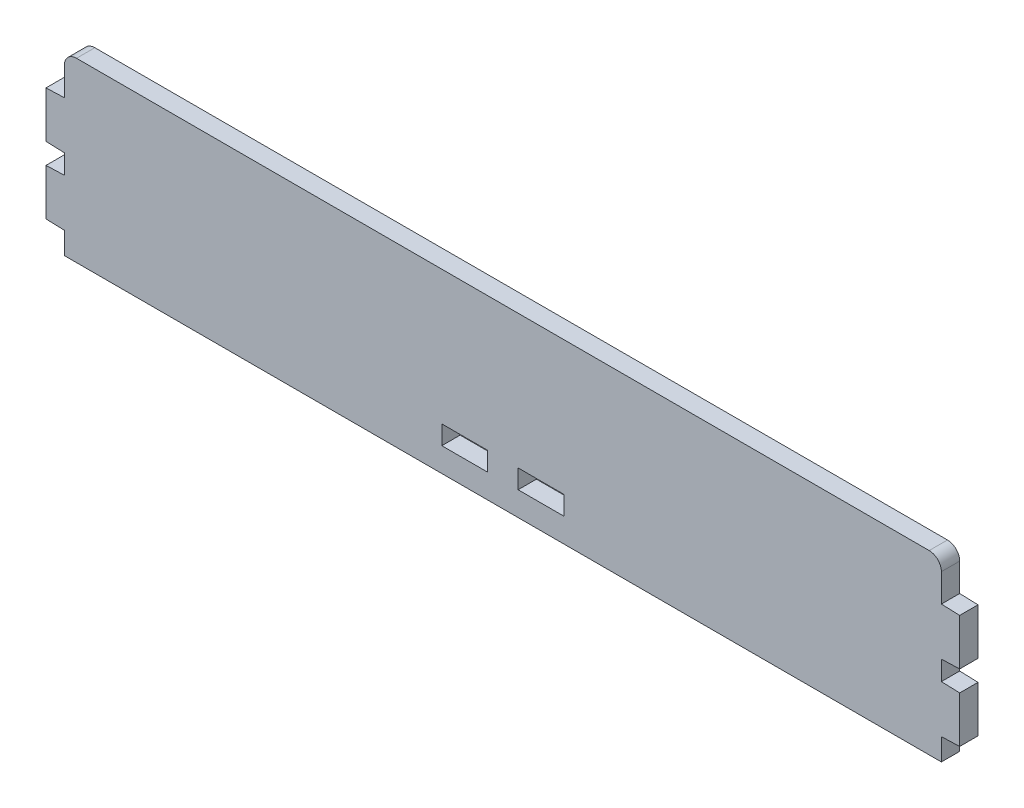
ISO-10303-21;
HEADER;
FILE_DESCRIPTION(('STEP AP214'),'2;1');
FILE_NAME('part.step','',(''),(''),'','','');
FILE_SCHEMA(('AUTOMOTIVE_DESIGN { 1 0 10303 214 1 1 1 1 }'));
ENDSEC;
DATA;
#1=APPLICATION_CONTEXT('core data for automotive mechanical design processes');
#2=APPLICATION_PROTOCOL_DEFINITION('international standard','automotive_design',2000,#1);
#3=PRODUCT_CONTEXT('',#1,'mechanical');
#4=PRODUCT('Part','Part','',(#3));
#5=PRODUCT_RELATED_PRODUCT_CATEGORY('part','',(#4));
#6=PRODUCT_DEFINITION_FORMATION('','',#4);
#7=PRODUCT_DEFINITION_CONTEXT('part definition',#1,'design');
#8=PRODUCT_DEFINITION('design','',#6,#7);
#9=PRODUCT_DEFINITION_SHAPE('','',#8);
#10=(LENGTH_UNIT() NAMED_UNIT(*) SI_UNIT(.MILLI.,.METRE.));
#11=(NAMED_UNIT(*) PLANE_ANGLE_UNIT() SI_UNIT($,.RADIAN.));
#12=(NAMED_UNIT(*) SI_UNIT($,.STERADIAN.) SOLID_ANGLE_UNIT());
#13=UNCERTAINTY_MEASURE_WITH_UNIT(LENGTH_MEASURE(1.E-05),#10,'distance_accuracy_value','');
#14=(GEOMETRIC_REPRESENTATION_CONTEXT(3) GLOBAL_UNCERTAINTY_ASSIGNED_CONTEXT((#13)) GLOBAL_UNIT_ASSIGNED_CONTEXT((#10,
#11,#12)) REPRESENTATION_CONTEXT('',''));
#15=CARTESIAN_POINT('',(0.,0.,0.));
#16=DIRECTION('',(0.,0.,1.));
#17=DIRECTION('',(1.,0.,0.));
#18=AXIS2_PLACEMENT_3D('',#15,#16,#17);
#19=CARTESIAN_POINT('',(146.5,66.,6.));
#20=DIRECTION('',(-1.,0.,0.));
#21=DIRECTION('',(0.,-1.,0.));
#22=AXIS2_PLACEMENT_3D('',#19,#20,#21);
#23=PLANE('',#22);
#24=DIRECTION('',(0.,1.,0.));
#25=VECTOR('',#24,1.);
#26=CARTESIAN_POINT('',(146.5,66.,0.));
#27=LINE('',#26,#25);
#28=CARTESIAN_POINT('',(146.5,30.8095246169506,0.));
#29=VERTEX_POINT('',#28);
#30=CARTESIAN_POINT('',(146.5,37.1904753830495,0.));
#31=VERTEX_POINT('',#30);
#32=EDGE_CURVE('E426',#29,#31,#27,.T.);
#33=ORIENTED_EDGE('',*,*,#32,.T.);
#34=DIRECTION('',(0.,0.,1.));
#35=VECTOR('',#34,1.);
#36=CARTESIAN_POINT('',(146.5,37.1904753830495,-16.7318468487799));
#37=LINE('',#36,#35);
#38=CARTESIAN_POINT('',(146.5,37.1904753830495,6.));
#39=VERTEX_POINT('',#38);
#40=EDGE_CURVE('E317',#31,#39,#37,.T.);
#41=ORIENTED_EDGE('',*,*,#40,.T.);
#42=DIRECTION('',(0.,1.,0.));
#43=VECTOR('',#42,1.);
#44=CARTESIAN_POINT('',(146.5,66.,6.));
#45=LINE('',#44,#43);
#46=CARTESIAN_POINT('',(146.5,30.8095246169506,6.));
#47=VERTEX_POINT('',#46);
#48=EDGE_CURVE('E413',#47,#39,#45,.T.);
#49=ORIENTED_EDGE('',*,*,#48,.F.);
#50=DIRECTION('',(0.,0.,1.));
#51=VECTOR('',#50,1.);
#52=CARTESIAN_POINT('',(146.5,30.8095246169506,-16.7318468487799));
#53=LINE('',#52,#51);
#54=EDGE_CURVE('E344',#29,#47,#53,.T.);
#55=ORIENTED_EDGE('',*,*,#54,.F.);
#56=EDGE_LOOP('',(#33,#41,#49,#55));
#57=FACE_BOUND('',#56,.T.);
#58=ADVANCED_FACE('F35',(#57),#23,.F.);
#59=CARTESIAN_POINT('',(146.5,52.8095246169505,0.));
#60=VERTEX_POINT('',#59);
#61=CARTESIAN_POINT('',(146.5,62.,0.));
#62=VERTEX_POINT('',#61);
#63=EDGE_CURVE('E422',#60,#62,#27,.T.);
#64=ORIENTED_EDGE('',*,*,#63,.T.);
#65=DIRECTION('',(0.,0.,-1.));
#66=VECTOR('',#65,1.);
#67=CARTESIAN_POINT('',(146.5,62.,6.));
#68=LINE('',#67,#66);
#69=CARTESIAN_POINT('',(146.5,62.,6.));
#70=VERTEX_POINT('',#69);
#71=EDGE_CURVE('E11',#62,#70,#68,.F.);
#72=ORIENTED_EDGE('',*,*,#71,.T.);
#73=CARTESIAN_POINT('',(146.5,52.8095246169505,6.));
#74=VERTEX_POINT('',#73);
#75=EDGE_CURVE('E408',#74,#70,#45,.T.);
#76=ORIENTED_EDGE('',*,*,#75,.F.);
#77=DIRECTION('',(0.,0.,1.));
#78=VECTOR('',#77,1.);
#79=CARTESIAN_POINT('',(146.5,52.8095246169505,-16.7318468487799));
#80=LINE('',#79,#78);
#81=EDGE_CURVE('E319',#60,#74,#80,.T.);
#82=ORIENTED_EDGE('',*,*,#81,.F.);
#83=EDGE_LOOP('',(#64,#72,#76,#82));
#84=FACE_BOUND('',#83,.T.);
#85=ADVANCED_FACE('F472',(#84),#23,.F.);
#86=CARTESIAN_POINT('',(-140.9,66.,6.));
#87=DIRECTION('',(1.,0.,0.));
#88=DIRECTION('',(0.,0.,-1.));
#89=AXIS2_PLACEMENT_3D('',#86,#87,#88);
#90=PLANE('',#89);
#91=DIRECTION('',(0.,-1.,0.));
#92=VECTOR('',#91,1.);
#93=CARTESIAN_POINT('',(-140.9,66.,6.));
#94=LINE('',#93,#92);
#95=CARTESIAN_POINT('',(-140.9,62.,6.));
#96=VERTEX_POINT('',#95);
#97=CARTESIAN_POINT('',(-140.9,52.8095246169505,6.));
#98=VERTEX_POINT('',#97);
#99=EDGE_CURVE('E402',#96,#98,#94,.T.);
#100=ORIENTED_EDGE('',*,*,#99,.F.);
#101=DIRECTION('',(0.,0.,-1.));
#102=VECTOR('',#101,1.);
#103=CARTESIAN_POINT('',(-140.9,62.,6.));
#104=LINE('',#103,#102);
#105=CARTESIAN_POINT('',(-140.9,62.,0.));
#106=VERTEX_POINT('',#105);
#107=EDGE_CURVE('E434',#96,#106,#104,.T.);
#108=ORIENTED_EDGE('',*,*,#107,.T.);
#109=DIRECTION('',(0.,-1.,0.));
#110=VECTOR('',#109,1.);
#111=CARTESIAN_POINT('',(-140.9,66.,0.));
#112=LINE('',#111,#110);
#113=CARTESIAN_POINT('',(-140.9,52.8095246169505,0.));
#114=VERTEX_POINT('',#113);
#115=EDGE_CURVE('E417',#106,#114,#112,.T.);
#116=ORIENTED_EDGE('',*,*,#115,.T.);
#117=DIRECTION('',(0.,0.,1.));
#118=VECTOR('',#117,1.);
#119=CARTESIAN_POINT('',(-140.9,52.8095246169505,-16.7318468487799));
#120=LINE('',#119,#118);
#121=EDGE_CURVE('E367',#114,#98,#120,.T.);
#122=ORIENTED_EDGE('',*,*,#121,.T.);
#123=EDGE_LOOP('',(#100,#108,#116,#122));
#124=FACE_BOUND('',#123,.T.);
#125=ADVANCED_FACE('F456',(#124),#90,.F.);
#126=DIRECTION('',(0.,0.,1.));
#127=VECTOR('',#126,1.);
#128=CARTESIAN_POINT('',(-140.9,15.1904753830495,-16.7318468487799));
#129=LINE('',#128,#127);
#130=CARTESIAN_POINT('',(-140.9,15.1904753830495,0.));
#131=VERTEX_POINT('',#130);
#132=CARTESIAN_POINT('',(-140.9,15.1904753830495,6.));
#133=VERTEX_POINT('',#132);
#134=EDGE_CURVE('E396',#131,#133,#129,.T.);
#135=ORIENTED_EDGE('',*,*,#134,.F.);
#136=CARTESIAN_POINT('',(-140.9,7.99999999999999,0.));
#137=VERTEX_POINT('',#136);
#138=EDGE_CURVE('E401',#131,#137,#112,.T.);
#139=ORIENTED_EDGE('',*,*,#138,.T.);
#140=DIRECTION('',(0.,0.,-1.));
#141=VECTOR('',#140,1.);
#142=CARTESIAN_POINT('',(-140.9,7.99999999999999,6.));
#143=LINE('',#142,#141);
#144=CARTESIAN_POINT('',(-140.9,7.99999999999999,6.));
#145=VERTEX_POINT('',#144);
#146=EDGE_CURVE('E431',#145,#137,#143,.T.);
#147=ORIENTED_EDGE('',*,*,#146,.F.);
#148=EDGE_CURVE('E406',#133,#145,#94,.T.);
#149=ORIENTED_EDGE('',*,*,#148,.F.);
#150=EDGE_LOOP('',(#135,#139,#147,#149));
#151=FACE_BOUND('',#150,.T.);
#152=ADVANCED_FACE('F677',(#151),#90,.F.);
#153=CARTESIAN_POINT('',(-140.9,37.1904753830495,6.));
#154=VERTEX_POINT('',#153);
#155=CARTESIAN_POINT('',(-140.9,30.8095246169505,6.));
#156=VERTEX_POINT('',#155);
#157=EDGE_CURVE('E405',#154,#156,#94,.T.);
#158=ORIENTED_EDGE('',*,*,#157,.F.);
#159=DIRECTION('',(0.,0.,1.));
#160=VECTOR('',#159,1.);
#161=CARTESIAN_POINT('',(-140.9,37.1904753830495,-16.7318468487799));
#162=LINE('',#161,#160);
#163=CARTESIAN_POINT('',(-140.9,37.1904753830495,0.));
#164=VERTEX_POINT('',#163);
#165=EDGE_CURVE('E370',#164,#154,#162,.T.);
#166=ORIENTED_EDGE('',*,*,#165,.F.);
#167=CARTESIAN_POINT('',(-140.9,30.8095246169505,0.));
#168=VERTEX_POINT('',#167);
#169=EDGE_CURVE('E420',#164,#168,#112,.T.);
#170=ORIENTED_EDGE('',*,*,#169,.T.);
#171=DIRECTION('',(0.,0.,1.));
#172=VECTOR('',#171,1.);
#173=CARTESIAN_POINT('',(-140.9,30.8095246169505,-16.7318468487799));
#174=LINE('',#173,#172);
#175=EDGE_CURVE('E393',#168,#156,#174,.T.);
#176=ORIENTED_EDGE('',*,*,#175,.T.);
#177=EDGE_LOOP('',(#158,#166,#170,#176));
#178=FACE_BOUND('',#177,.T.);
#179=ADVANCED_FACE('F522',(#178),#90,.F.);
#180=CARTESIAN_POINT('',(-140.9,7.99999999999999,6.));
#181=DIRECTION('',(0.,1.,0.));
#182=DIRECTION('',(0.,0.,1.));
#183=AXIS2_PLACEMENT_3D('',#180,#181,#182);
#184=PLANE('',#183);
#185=DIRECTION('',(1.,0.,0.));
#186=VECTOR('',#185,1.);
#187=CARTESIAN_POINT('',(-140.9,7.99999999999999,0.));
#188=LINE('',#187,#186);
#189=CARTESIAN_POINT('',(146.5,7.99999999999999,0.));
#190=VERTEX_POINT('',#189);
#191=EDGE_CURVE('E419',#137,#190,#188,.T.);
#192=ORIENTED_EDGE('',*,*,#191,.T.);
#193=DIRECTION('',(0.,0.,-1.));
#194=VECTOR('',#193,1.);
#195=CARTESIAN_POINT('',(146.5,7.99999999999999,6.));
#196=LINE('',#195,#194);
#197=CARTESIAN_POINT('',(146.5,7.99999999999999,6.));
#198=VERTEX_POINT('',#197);
#199=EDGE_CURVE('E416',#198,#190,#196,.T.);
#200=ORIENTED_EDGE('',*,*,#199,.F.);
#201=DIRECTION('',(1.,0.,0.));
#202=VECTOR('',#201,1.);
#203=CARTESIAN_POINT('',(-140.9,7.99999999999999,6.));
#204=LINE('',#203,#202);
#205=EDGE_CURVE('E404',#145,#198,#204,.T.);
#206=ORIENTED_EDGE('',*,*,#205,.F.);
#207=ORIENTED_EDGE('',*,*,#146,.T.);
#208=EDGE_LOOP('',(#192,#200,#206,#207));
#209=FACE_BOUND('',#208,.T.);
#210=ADVANCED_FACE('F516',(#209),#184,.F.);
#211=CARTESIAN_POINT('',(146.5,15.1904753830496,0.));
#212=VERTEX_POINT('',#211);
#213=EDGE_CURVE('E423',#190,#212,#27,.T.);
#214=ORIENTED_EDGE('',*,*,#213,.T.);
#215=DIRECTION('',(0.,0.,1.));
#216=VECTOR('',#215,1.);
#217=CARTESIAN_POINT('',(146.5,15.1904753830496,-16.7318468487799));
#218=LINE('',#217,#216);
#219=CARTESIAN_POINT('',(146.5,15.1904753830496,6.));
#220=VERTEX_POINT('',#219);
#221=EDGE_CURVE('E342',#212,#220,#218,.T.);
#222=ORIENTED_EDGE('',*,*,#221,.T.);
#223=EDGE_CURVE('E409',#198,#220,#45,.T.);
#224=ORIENTED_EDGE('',*,*,#223,.F.);
#225=ORIENTED_EDGE('',*,*,#199,.T.);
#226=EDGE_LOOP('',(#214,#222,#224,#225));
#227=FACE_BOUND('',#226,.T.);
#228=ADVANCED_FACE('F509',(#227),#23,.F.);
#229=CARTESIAN_POINT('',(-140.9,66.,6.));
#230=DIRECTION('',(0.,-1.,0.));
#231=DIRECTION('',(0.,0.,-1.));
#232=AXIS2_PLACEMENT_3D('',#229,#230,#231);
#233=PLANE('',#232);
#234=DIRECTION('',(-1.,0.,0.));
#235=VECTOR('',#234,1.);
#236=CARTESIAN_POINT('',(-140.9,66.,0.));
#237=LINE('',#236,#235);
#238=CARTESIAN_POINT('',(142.5,66.,0.));
#239=VERTEX_POINT('',#238);
#240=CARTESIAN_POINT('',(-136.9,66.,0.));
#241=VERTEX_POINT('',#240);
#242=EDGE_CURVE('E425',#239,#241,#237,.T.);
#243=ORIENTED_EDGE('',*,*,#242,.T.);
#244=DIRECTION('',(0.,0.,-1.));
#245=VECTOR('',#244,1.);
#246=CARTESIAN_POINT('',(-136.9,66.,6.));
#247=LINE('',#246,#245);
#248=CARTESIAN_POINT('',(-136.9,66.,6.));
#249=VERTEX_POINT('',#248);
#250=EDGE_CURVE('E444',#241,#249,#247,.F.);
#251=ORIENTED_EDGE('',*,*,#250,.T.);
#252=DIRECTION('',(-1.,0.,0.));
#253=VECTOR('',#252,1.);
#254=CARTESIAN_POINT('',(-140.9,66.,6.));
#255=LINE('',#254,#253);
#256=CARTESIAN_POINT('',(142.5,66.,6.));
#257=VERTEX_POINT('',#256);
#258=EDGE_CURVE('E412',#257,#249,#255,.T.);
#259=ORIENTED_EDGE('',*,*,#258,.F.);
#260=DIRECTION('',(0.,0.,-1.));
#261=VECTOR('',#260,1.);
#262=CARTESIAN_POINT('',(142.5,66.,6.));
#263=LINE('',#262,#261);
#264=EDGE_CURVE('E441',#257,#239,#263,.T.);
#265=ORIENTED_EDGE('',*,*,#264,.T.);
#266=EDGE_LOOP('',(#243,#251,#259,#265));
#267=FACE_BOUND('',#266,.T.);
#268=ADVANCED_FACE('F464',(#267),#233,.F.);
#269=CARTESIAN_POINT('',(0.,0.,6.));
#270=DIRECTION('',(0.,0.,1.));
#271=DIRECTION('',(1.,0.,0.));
#272=AXIS2_PLACEMENT_3D('',#269,#270,#271);
#273=PLANE('',#272);
#274=DIRECTION('',(0.,-1.,0.));
#275=VECTOR('',#274,1.);
#276=CARTESIAN_POINT('',(-17.1999999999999,22.1,6.));
#277=LINE('',#276,#275);
#278=CARTESIAN_POINT('',(-17.1999999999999,22.1,6.));
#279=VERTEX_POINT('',#278);
#280=CARTESIAN_POINT('',(-17.1999999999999,15.9,6.));
#281=VERTEX_POINT('',#280);
#282=EDGE_CURVE('E50',#279,#281,#277,.T.);
#283=ORIENTED_EDGE('',*,*,#282,.F.);
#284=DIRECTION('',(-1.,0.,0.));
#285=VECTOR('',#284,1.);
#286=CARTESIAN_POINT('',(-2.19999999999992,22.1,6.));
#287=LINE('',#286,#285);
#288=CARTESIAN_POINT('',(-2.19999999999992,22.1,6.));
#289=VERTEX_POINT('',#288);
#290=EDGE_CURVE('E239',#289,#279,#287,.T.);
#291=ORIENTED_EDGE('',*,*,#290,.F.);
#292=DIRECTION('',(0.,1.,0.));
#293=VECTOR('',#292,1.);
#294=CARTESIAN_POINT('',(-2.19999999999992,15.9,6.));
#295=LINE('',#294,#293);
#296=CARTESIAN_POINT('',(-2.19999999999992,15.9,6.));
#297=VERTEX_POINT('',#296);
#298=EDGE_CURVE('E262',#297,#289,#295,.T.);
#299=ORIENTED_EDGE('',*,*,#298,.F.);
#300=DIRECTION('',(1.,0.,0.));
#301=VECTOR('',#300,1.);
#302=CARTESIAN_POINT('',(-17.1999999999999,15.9,6.));
#303=LINE('',#302,#301);
#304=EDGE_CURVE('E255',#281,#297,#303,.T.);
#305=ORIENTED_EDGE('',*,*,#304,.F.);
#306=EDGE_LOOP('',(#283,#291,#299,#305));
#307=FACE_BOUND('',#306,.T.);
#308=DIRECTION('',(0.,-1.,0.));
#309=VECTOR('',#308,1.);
#310=CARTESIAN_POINT('',(7.80000000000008,22.1,6.));
#311=LINE('',#310,#309);
#312=CARTESIAN_POINT('',(7.80000000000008,22.1,6.));
#313=VERTEX_POINT('',#312);
#314=CARTESIAN_POINT('',(7.80000000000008,15.9,6.));
#315=VERTEX_POINT('',#314);
#316=EDGE_CURVE('E58',#313,#315,#311,.T.);
#317=ORIENTED_EDGE('',*,*,#316,.F.);
#318=DIRECTION('',(-1.,0.,0.));
#319=VECTOR('',#318,1.);
#320=CARTESIAN_POINT('',(22.8000000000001,22.1,6.));
#321=LINE('',#320,#319);
#322=CARTESIAN_POINT('',(22.8000000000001,22.1,6.));
#323=VERTEX_POINT('',#322);
#324=EDGE_CURVE('E286',#323,#313,#321,.T.);
#325=ORIENTED_EDGE('',*,*,#324,.F.);
#326=DIRECTION('',(0.,1.,0.));
#327=VECTOR('',#326,1.);
#328=CARTESIAN_POINT('',(22.8000000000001,15.9,6.));
#329=LINE('',#328,#327);
#330=CARTESIAN_POINT('',(22.8000000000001,15.9,6.));
#331=VERTEX_POINT('',#330);
#332=EDGE_CURVE('E283',#331,#323,#329,.T.);
#333=ORIENTED_EDGE('',*,*,#332,.F.);
#334=DIRECTION('',(1.,0.,0.));
#335=VECTOR('',#334,1.);
#336=CARTESIAN_POINT('',(7.80000000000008,15.9,6.));
#337=LINE('',#336,#335);
#338=EDGE_CURVE('E280',#315,#331,#337,.T.);
#339=ORIENTED_EDGE('',*,*,#338,.F.);
#340=EDGE_LOOP('',(#317,#325,#333,#339));
#341=FACE_BOUND('',#340,.T.);
#342=ORIENTED_EDGE('',*,*,#258,.T.);
#343=CARTESIAN_POINT('',(-136.9,62.,6.));
#344=DIRECTION('',(0.,0.,1.));
#345=DIRECTION('',(1.,0.,0.));
#346=AXIS2_PLACEMENT_3D('',#343,#344,#345);
#347=CIRCLE('',#346,4.);
#348=EDGE_CURVE('E43',#249,#96,#347,.T.);
#349=ORIENTED_EDGE('',*,*,#348,.T.);
#350=ORIENTED_EDGE('',*,*,#99,.T.);
#351=DIRECTION('',(-0.999390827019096,-0.0348994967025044,0.));
#352=VECTOR('',#351,1.);
#353=CARTESIAN_POINT('',(-140.9,52.8095246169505,6.));
#354=LINE('',#353,#352);
#355=CARTESIAN_POINT('',(-146.9,52.6,6.));
#356=VERTEX_POINT('',#355);
#357=EDGE_CURVE('E362',#98,#356,#354,.T.);
#358=ORIENTED_EDGE('',*,*,#357,.T.);
#359=DIRECTION('',(0.,-1.,0.));
#360=VECTOR('',#359,1.);
#361=CARTESIAN_POINT('',(-146.9,52.6,6.));
#362=LINE('',#361,#360);
#363=CARTESIAN_POINT('',(-146.9,37.4,6.));
#364=VERTEX_POINT('',#363);
#365=EDGE_CURVE('E349',#356,#364,#362,.T.);
#366=ORIENTED_EDGE('',*,*,#365,.T.);
#367=DIRECTION('',(0.999390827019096,-0.0348994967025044,0.));
#368=VECTOR('',#367,1.);
#369=CARTESIAN_POINT('',(-140.9,37.1904753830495,6.));
#370=LINE('',#369,#368);
#371=EDGE_CURVE('E359',#364,#154,#370,.T.);
#372=ORIENTED_EDGE('',*,*,#371,.T.);
#373=ORIENTED_EDGE('',*,*,#157,.T.);
#374=DIRECTION('',(-0.999390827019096,-0.0348994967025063,0.));
#375=VECTOR('',#374,1.);
#376=CARTESIAN_POINT('',(-140.9,30.8095246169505,6.));
#377=LINE('',#376,#375);
#378=CARTESIAN_POINT('',(-146.9,30.6,6.));
#379=VERTEX_POINT('',#378);
#380=EDGE_CURVE('E388',#156,#379,#377,.T.);
#381=ORIENTED_EDGE('',*,*,#380,.T.);
#382=DIRECTION('',(0.,-1.,0.));
#383=VECTOR('',#382,1.);
#384=CARTESIAN_POINT('',(-146.9,30.6,6.));
#385=LINE('',#384,#383);
#386=CARTESIAN_POINT('',(-146.9,15.4,6.));
#387=VERTEX_POINT('',#386);
#388=EDGE_CURVE('E375',#379,#387,#385,.T.);
#389=ORIENTED_EDGE('',*,*,#388,.T.);
#390=DIRECTION('',(0.999390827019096,-0.0348994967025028,0.));
#391=VECTOR('',#390,1.);
#392=CARTESIAN_POINT('',(-140.9,15.1904753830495,6.));
#393=LINE('',#392,#391);
#394=EDGE_CURVE('E385',#387,#133,#393,.T.);
#395=ORIENTED_EDGE('',*,*,#394,.T.);
#396=ORIENTED_EDGE('',*,*,#148,.T.);
#397=ORIENTED_EDGE('',*,*,#205,.T.);
#398=ORIENTED_EDGE('',*,*,#223,.T.);
#399=DIRECTION('',(0.999390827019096,0.034899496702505,0.));
#400=VECTOR('',#399,1.);
#401=CARTESIAN_POINT('',(146.5,15.1904753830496,6.));
#402=LINE('',#401,#400);
#403=CARTESIAN_POINT('',(152.5,15.4000000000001,6.));
#404=VERTEX_POINT('',#403);
#405=EDGE_CURVE('E337',#220,#404,#402,.T.);
#406=ORIENTED_EDGE('',*,*,#405,.T.);
#407=DIRECTION('',(0.,1.,0.));
#408=VECTOR('',#407,1.);
#409=CARTESIAN_POINT('',(152.5,15.4000000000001,6.));
#410=LINE('',#409,#408);
#411=CARTESIAN_POINT('',(152.5,30.6000000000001,6.));
#412=VERTEX_POINT('',#411);
#413=EDGE_CURVE('E324',#404,#412,#410,.T.);
#414=ORIENTED_EDGE('',*,*,#413,.T.);
#415=DIRECTION('',(-0.999390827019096,0.0348994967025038,0.));
#416=VECTOR('',#415,1.);
#417=CARTESIAN_POINT('',(146.5,30.8095246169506,6.));
#418=LINE('',#417,#416);
#419=EDGE_CURVE('E334',#412,#47,#418,.T.);
#420=ORIENTED_EDGE('',*,*,#419,.T.);
#421=ORIENTED_EDGE('',*,*,#48,.T.);
#422=DIRECTION('',(0.999390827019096,0.0348994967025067,0.));
#423=VECTOR('',#422,1.);
#424=CARTESIAN_POINT('',(146.5,37.1904753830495,6.));
#425=LINE('',#424,#423);
#426=CARTESIAN_POINT('',(152.5,37.4000000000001,6.));
#427=VERTEX_POINT('',#426);
#428=EDGE_CURVE('E312',#39,#427,#425,.T.);
#429=ORIENTED_EDGE('',*,*,#428,.T.);
#430=DIRECTION('',(0.,1.,0.));
#431=VECTOR('',#430,1.);
#432=CARTESIAN_POINT('',(152.5,37.4000000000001,6.));
#433=LINE('',#432,#431);
#434=CARTESIAN_POINT('',(152.5,52.6000000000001,6.));
#435=VERTEX_POINT('',#434);
#436=EDGE_CURVE('E247',#427,#435,#433,.T.);
#437=ORIENTED_EDGE('',*,*,#436,.T.);
#438=DIRECTION('',(-0.999390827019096,0.0348994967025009,0.));
#439=VECTOR('',#438,1.);
#440=CARTESIAN_POINT('',(146.5,52.8095246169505,6.));
#441=LINE('',#440,#439);
#442=EDGE_CURVE('E309',#435,#74,#441,.T.);
#443=ORIENTED_EDGE('',*,*,#442,.T.);
#444=ORIENTED_EDGE('',*,*,#75,.T.);
#445=CARTESIAN_POINT('',(142.5,62.,6.));
#446=DIRECTION('',(0.,0.,1.));
#447=DIRECTION('',(1.,0.,0.));
#448=AXIS2_PLACEMENT_3D('',#445,#446,#447);
#449=CIRCLE('',#448,4.);
#450=EDGE_CURVE('E446',#70,#257,#449,.T.);
#451=ORIENTED_EDGE('',*,*,#450,.T.);
#452=EDGE_LOOP('',(#342,#349,#350,#358,#366,#372,#373,#381,#389,#395,#396,#397,#398,#406,#414,
#420,#421,#429,#437,#443,#444,#451));
#453=FACE_BOUND('',#452,.T.);
#454=ADVANCED_FACE('F450',(#307,#341,#453),#273,.T.);
#455=CARTESIAN_POINT('',(0.,0.,0.));
#456=DIRECTION('',(0.,0.,1.));
#457=DIRECTION('',(1.,0.,0.));
#458=AXIS2_PLACEMENT_3D('',#455,#456,#457);
#459=PLANE('',#458);
#460=DIRECTION('',(1.,0.,0.));
#461=VECTOR('',#460,1.);
#462=CARTESIAN_POINT('',(-2.19999999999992,22.1,0.));
#463=LINE('',#462,#461);
#464=CARTESIAN_POINT('',(-17.1999999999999,22.1,0.));
#465=VERTEX_POINT('',#464);
#466=CARTESIAN_POINT('',(-2.19999999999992,22.1,0.));
#467=VERTEX_POINT('',#466);
#468=EDGE_CURVE('E253',#465,#467,#463,.T.);
#469=ORIENTED_EDGE('',*,*,#468,.F.);
#470=DIRECTION('',(0.,1.,0.));
#471=VECTOR('',#470,1.);
#472=CARTESIAN_POINT('',(-17.1999999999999,22.1,0.));
#473=LINE('',#472,#471);
#474=CARTESIAN_POINT('',(-17.1999999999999,15.9,0.));
#475=VERTEX_POINT('',#474);
#476=EDGE_CURVE('E233',#475,#465,#473,.T.);
#477=ORIENTED_EDGE('',*,*,#476,.F.);
#478=DIRECTION('',(-1.,0.,0.));
#479=VECTOR('',#478,1.);
#480=CARTESIAN_POINT('',(-17.1999999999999,15.9,0.));
#481=LINE('',#480,#479);
#482=CARTESIAN_POINT('',(-2.19999999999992,15.9,0.));
#483=VERTEX_POINT('',#482);
#484=EDGE_CURVE('E243',#483,#475,#481,.T.);
#485=ORIENTED_EDGE('',*,*,#484,.F.);
#486=DIRECTION('',(0.,-1.,0.));
#487=VECTOR('',#486,1.);
#488=CARTESIAN_POINT('',(-2.19999999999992,15.9,0.));
#489=LINE('',#488,#487);
#490=EDGE_CURVE('E257',#467,#483,#489,.T.);
#491=ORIENTED_EDGE('',*,*,#490,.F.);
#492=EDGE_LOOP('',(#469,#477,#485,#491));
#493=FACE_BOUND('',#492,.T.);
#494=DIRECTION('',(1.,0.,0.));
#495=VECTOR('',#494,1.);
#496=CARTESIAN_POINT('',(22.8000000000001,22.1,0.));
#497=LINE('',#496,#495);
#498=CARTESIAN_POINT('',(7.80000000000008,22.1,0.));
#499=VERTEX_POINT('',#498);
#500=CARTESIAN_POINT('',(22.8000000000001,22.1,0.));
#501=VERTEX_POINT('',#500);
#502=EDGE_CURVE('E273',#499,#501,#497,.T.);
#503=ORIENTED_EDGE('',*,*,#502,.F.);
#504=DIRECTION('',(0.,1.,0.));
#505=VECTOR('',#504,1.);
#506=CARTESIAN_POINT('',(7.80000000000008,22.1,0.));
#507=LINE('',#506,#505);
#508=CARTESIAN_POINT('',(7.80000000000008,15.9,0.));
#509=VERTEX_POINT('',#508);
#510=EDGE_CURVE('E276',#509,#499,#507,.T.);
#511=ORIENTED_EDGE('',*,*,#510,.F.);
#512=DIRECTION('',(-1.,0.,0.));
#513=VECTOR('',#512,1.);
#514=CARTESIAN_POINT('',(7.80000000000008,15.9,0.));
#515=LINE('',#514,#513);
#516=CARTESIAN_POINT('',(22.8000000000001,15.9,0.));
#517=VERTEX_POINT('',#516);
#518=EDGE_CURVE('E292',#517,#509,#515,.T.);
#519=ORIENTED_EDGE('',*,*,#518,.F.);
#520=DIRECTION('',(0.,-1.,0.));
#521=VECTOR('',#520,1.);
#522=CARTESIAN_POINT('',(22.8000000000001,15.9,0.));
#523=LINE('',#522,#521);
#524=EDGE_CURVE('E271',#501,#517,#523,.T.);
#525=ORIENTED_EDGE('',*,*,#524,.F.);
#526=EDGE_LOOP('',(#503,#511,#519,#525));
#527=FACE_BOUND('',#526,.T.);
#528=ORIENTED_EDGE('',*,*,#115,.F.);
#529=CARTESIAN_POINT('',(-136.9,62.,0.));
#530=DIRECTION('',(0.,0.,1.));
#531=DIRECTION('',(1.,0.,0.));
#532=AXIS2_PLACEMENT_3D('',#529,#530,#531);
#533=CIRCLE('',#532,4.);
#534=EDGE_CURVE('E439',#106,#241,#533,.F.);
#535=ORIENTED_EDGE('',*,*,#534,.T.);
#536=ORIENTED_EDGE('',*,*,#242,.F.);
#537=CARTESIAN_POINT('',(142.5,62.,0.));
#538=DIRECTION('',(0.,0.,1.));
#539=DIRECTION('',(1.,0.,0.));
#540=AXIS2_PLACEMENT_3D('',#537,#538,#539);
#541=CIRCLE('',#540,4.);
#542=EDGE_CURVE('E437',#239,#62,#541,.F.);
#543=ORIENTED_EDGE('',*,*,#542,.T.);
#544=ORIENTED_EDGE('',*,*,#63,.F.);
#545=DIRECTION('',(0.999390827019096,-0.0348994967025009,0.));
#546=VECTOR('',#545,1.);
#547=CARTESIAN_POINT('',(146.5,52.8095246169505,0.));
#548=LINE('',#547,#546);
#549=CARTESIAN_POINT('',(152.5,52.6000000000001,0.));
#550=VERTEX_POINT('',#549);
#551=EDGE_CURVE('E306',#60,#550,#548,.T.);
#552=ORIENTED_EDGE('',*,*,#551,.T.);
#553=DIRECTION('',(0.,-1.,0.));
#554=VECTOR('',#553,1.);
#555=CARTESIAN_POINT('',(152.5,37.4000000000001,0.));
#556=LINE('',#555,#554);
#557=CARTESIAN_POINT('',(152.5,37.4000000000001,0.));
#558=VERTEX_POINT('',#557);
#559=EDGE_CURVE('E303',#550,#558,#556,.T.);
#560=ORIENTED_EDGE('',*,*,#559,.T.);
#561=DIRECTION('',(-0.999390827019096,-0.0348994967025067,0.));
#562=VECTOR('',#561,1.);
#563=CARTESIAN_POINT('',(146.5,37.1904753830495,0.));
#564=LINE('',#563,#562);
#565=EDGE_CURVE('E300',#558,#31,#564,.T.);
#566=ORIENTED_EDGE('',*,*,#565,.T.);
#567=ORIENTED_EDGE('',*,*,#32,.F.);
#568=DIRECTION('',(0.999390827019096,-0.0348994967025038,0.));
#569=VECTOR('',#568,1.);
#570=CARTESIAN_POINT('',(146.5,30.8095246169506,0.));
#571=LINE('',#570,#569);
#572=CARTESIAN_POINT('',(152.5,30.6000000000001,0.));
#573=VERTEX_POINT('',#572);
#574=EDGE_CURVE('E331',#29,#573,#571,.T.);
#575=ORIENTED_EDGE('',*,*,#574,.T.);
#576=DIRECTION('',(0.,-1.,0.));
#577=VECTOR('',#576,1.);
#578=CARTESIAN_POINT('',(152.5,15.4000000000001,0.));
#579=LINE('',#578,#577);
#580=CARTESIAN_POINT('',(152.5,15.4000000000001,0.));
#581=VERTEX_POINT('',#580);
#582=EDGE_CURVE('E328',#573,#581,#579,.T.);
#583=ORIENTED_EDGE('',*,*,#582,.T.);
#584=DIRECTION('',(-0.999390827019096,-0.034899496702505,0.));
#585=VECTOR('',#584,1.);
#586=CARTESIAN_POINT('',(146.5,15.1904753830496,0.));
#587=LINE('',#586,#585);
#588=EDGE_CURVE('E325',#581,#212,#587,.T.);
#589=ORIENTED_EDGE('',*,*,#588,.T.);
#590=ORIENTED_EDGE('',*,*,#213,.F.);
#591=ORIENTED_EDGE('',*,*,#191,.F.);
#592=ORIENTED_EDGE('',*,*,#138,.F.);
#593=DIRECTION('',(-0.999390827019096,0.0348994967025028,0.));
#594=VECTOR('',#593,1.);
#595=CARTESIAN_POINT('',(-140.9,15.1904753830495,0.));
#596=LINE('',#595,#594);
#597=CARTESIAN_POINT('',(-146.9,15.4,0.));
#598=VERTEX_POINT('',#597);
#599=EDGE_CURVE('E382',#131,#598,#596,.T.);
#600=ORIENTED_EDGE('',*,*,#599,.T.);
#601=DIRECTION('',(0.,1.,0.));
#602=VECTOR('',#601,1.);
#603=CARTESIAN_POINT('',(-146.9,30.6,0.));
#604=LINE('',#603,#602);
#605=CARTESIAN_POINT('',(-146.9,30.6,0.));
#606=VERTEX_POINT('',#605);
#607=EDGE_CURVE('E379',#598,#606,#604,.T.);
#608=ORIENTED_EDGE('',*,*,#607,.T.);
#609=DIRECTION('',(0.999390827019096,0.0348994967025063,0.));
#610=VECTOR('',#609,1.);
#611=CARTESIAN_POINT('',(-140.9,30.8095246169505,0.));
#612=LINE('',#611,#610);
#613=EDGE_CURVE('E376',#606,#168,#612,.T.);
#614=ORIENTED_EDGE('',*,*,#613,.T.);
#615=ORIENTED_EDGE('',*,*,#169,.F.);
#616=DIRECTION('',(-0.999390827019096,0.0348994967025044,0.));
#617=VECTOR('',#616,1.);
#618=CARTESIAN_POINT('',(-140.9,37.1904753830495,0.));
#619=LINE('',#618,#617);
#620=CARTESIAN_POINT('',(-146.9,37.4,0.));
#621=VERTEX_POINT('',#620);
#622=EDGE_CURVE('E356',#164,#621,#619,.T.);
#623=ORIENTED_EDGE('',*,*,#622,.T.);
#624=DIRECTION('',(0.,1.,0.));
#625=VECTOR('',#624,1.);
#626=CARTESIAN_POINT('',(-146.9,52.6,0.));
#627=LINE('',#626,#625);
#628=CARTESIAN_POINT('',(-146.9,52.6,0.));
#629=VERTEX_POINT('',#628);
#630=EDGE_CURVE('E353',#621,#629,#627,.T.);
#631=ORIENTED_EDGE('',*,*,#630,.T.);
#632=DIRECTION('',(0.999390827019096,0.0348994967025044,0.));
#633=VECTOR('',#632,1.);
#634=CARTESIAN_POINT('',(-140.9,52.8095246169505,0.));
#635=LINE('',#634,#633);
#636=EDGE_CURVE('E350',#629,#114,#635,.T.);
#637=ORIENTED_EDGE('',*,*,#636,.T.);
#638=EDGE_LOOP('',(#528,#535,#536,#543,#544,#552,#560,#566,#567,#575,#583,#589,#590,#591,#592,
#600,#608,#614,#615,#623,#631,#637));
#639=FACE_BOUND('',#638,.T.);
#640=ADVANCED_FACE('F250',(#493,#527,#639),#459,.F.);
#641=CARTESIAN_POINT('',(-146.9,30.6,-16.7318468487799));
#642=DIRECTION('',(-1.,0.,0.));
#643=DIRECTION('',(0.,-1.,0.));
#644=AXIS2_PLACEMENT_3D('',#641,#642,#643);
#645=PLANE('',#644);
#646=ORIENTED_EDGE('',*,*,#607,.F.);
#647=DIRECTION('',(0.,0.,1.));
#648=VECTOR('',#647,1.);
#649=CARTESIAN_POINT('',(-146.9,15.4,-16.7318468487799));
#650=LINE('',#649,#648);
#651=EDGE_CURVE('E391',#598,#387,#650,.T.);
#652=ORIENTED_EDGE('',*,*,#651,.T.);
#653=ORIENTED_EDGE('',*,*,#388,.F.);
#654=DIRECTION('',(0.,0.,1.));
#655=VECTOR('',#654,1.);
#656=CARTESIAN_POINT('',(-146.9,30.6,-16.7318468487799));
#657=LINE('',#656,#655);
#658=EDGE_CURVE('E380',#606,#379,#657,.T.);
#659=ORIENTED_EDGE('',*,*,#658,.F.);
#660=EDGE_LOOP('',(#646,#652,#653,#659));
#661=FACE_BOUND('',#660,.T.);
#662=ADVANCED_FACE('F547',(#661),#645,.T.);
#663=CARTESIAN_POINT('',(-140.9,30.8095246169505,-16.7318468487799));
#664=DIRECTION('',(-0.0348994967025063,0.999390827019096,0.));
#665=DIRECTION('',(-0.999390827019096,-0.0348994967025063,0.));
#666=AXIS2_PLACEMENT_3D('',#663,#664,#665);
#667=PLANE('',#666);
#668=ORIENTED_EDGE('',*,*,#613,.F.);
#669=ORIENTED_EDGE('',*,*,#658,.T.);
#670=ORIENTED_EDGE('',*,*,#380,.F.);
#671=ORIENTED_EDGE('',*,*,#175,.F.);
#672=EDGE_LOOP('',(#668,#669,#670,#671));
#673=FACE_BOUND('',#672,.T.);
#674=ADVANCED_FACE('F552',(#673),#667,.T.);
#675=CARTESIAN_POINT('',(-140.9,15.1904753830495,-16.7318468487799));
#676=DIRECTION('',(-0.0348994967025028,-0.999390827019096,0.));
#677=DIRECTION('',(0.999390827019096,-0.0348994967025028,0.));
#678=AXIS2_PLACEMENT_3D('',#675,#676,#677);
#679=PLANE('',#678);
#680=ORIENTED_EDGE('',*,*,#599,.F.);
#681=ORIENTED_EDGE('',*,*,#134,.T.);
#682=ORIENTED_EDGE('',*,*,#394,.F.);
#683=ORIENTED_EDGE('',*,*,#651,.F.);
#684=EDGE_LOOP('',(#680,#681,#682,#683));
#685=FACE_BOUND('',#684,.T.);
#686=ADVANCED_FACE('F543',(#685),#679,.T.);
#687=CARTESIAN_POINT('',(-146.9,52.6,-16.7318468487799));
#688=DIRECTION('',(-1.,0.,0.));
#689=DIRECTION('',(0.,0.,1.));
#690=AXIS2_PLACEMENT_3D('',#687,#688,#689);
#691=PLANE('',#690);
#692=ORIENTED_EDGE('',*,*,#630,.F.);
#693=DIRECTION('',(0.,0.,1.));
#694=VECTOR('',#693,1.);
#695=CARTESIAN_POINT('',(-146.9,37.4,-16.7318468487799));
#696=LINE('',#695,#694);
#697=EDGE_CURVE('E365',#621,#364,#696,.T.);
#698=ORIENTED_EDGE('',*,*,#697,.T.);
#699=ORIENTED_EDGE('',*,*,#365,.F.);
#700=DIRECTION('',(0.,0.,1.));
#701=VECTOR('',#700,1.);
#702=CARTESIAN_POINT('',(-146.9,52.6,-16.7318468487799));
#703=LINE('',#702,#701);
#704=EDGE_CURVE('E354',#629,#356,#703,.T.);
#705=ORIENTED_EDGE('',*,*,#704,.F.);
#706=EDGE_LOOP('',(#692,#698,#699,#705));
#707=FACE_BOUND('',#706,.T.);
#708=ADVANCED_FACE('F563',(#707),#691,.T.);
#709=CARTESIAN_POINT('',(-140.9,52.8095246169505,-16.7318468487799));
#710=DIRECTION('',(-0.0348994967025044,0.999390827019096,0.));
#711=DIRECTION('',(-0.999390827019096,-0.0348994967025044,0.));
#712=AXIS2_PLACEMENT_3D('',#709,#710,#711);
#713=PLANE('',#712);
#714=ORIENTED_EDGE('',*,*,#636,.F.);
#715=ORIENTED_EDGE('',*,*,#704,.T.);
#716=ORIENTED_EDGE('',*,*,#357,.F.);
#717=ORIENTED_EDGE('',*,*,#121,.F.);
#718=EDGE_LOOP('',(#714,#715,#716,#717));
#719=FACE_BOUND('',#718,.T.);
#720=ADVANCED_FACE('F568',(#719),#713,.T.);
#721=CARTESIAN_POINT('',(-140.9,37.1904753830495,-16.7318468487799));
#722=DIRECTION('',(-0.0348994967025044,-0.999390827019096,0.));
#723=DIRECTION('',(0.999390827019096,-0.0348994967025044,0.));
#724=AXIS2_PLACEMENT_3D('',#721,#722,#723);
#725=PLANE('',#724);
#726=ORIENTED_EDGE('',*,*,#622,.F.);
#727=ORIENTED_EDGE('',*,*,#165,.T.);
#728=ORIENTED_EDGE('',*,*,#371,.F.);
#729=ORIENTED_EDGE('',*,*,#697,.F.);
#730=EDGE_LOOP('',(#726,#727,#728,#729));
#731=FACE_BOUND('',#730,.T.);
#732=ADVANCED_FACE('F566',(#731),#725,.T.);
#733=CARTESIAN_POINT('',(152.5,15.4000000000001,-16.7318468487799));
#734=DIRECTION('',(1.,0.,0.));
#735=DIRECTION('',(0.,0.,-1.));
#736=AXIS2_PLACEMENT_3D('',#733,#734,#735);
#737=PLANE('',#736);
#738=ORIENTED_EDGE('',*,*,#582,.F.);
#739=DIRECTION('',(0.,0.,1.));
#740=VECTOR('',#739,1.);
#741=CARTESIAN_POINT('',(152.5,30.6000000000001,-16.7318468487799));
#742=LINE('',#741,#740);
#743=EDGE_CURVE('E340',#573,#412,#742,.T.);
#744=ORIENTED_EDGE('',*,*,#743,.T.);
#745=ORIENTED_EDGE('',*,*,#413,.F.);
#746=DIRECTION('',(0.,0.,1.));
#747=VECTOR('',#746,1.);
#748=CARTESIAN_POINT('',(152.5,15.4000000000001,-16.7318468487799));
#749=LINE('',#748,#747);
#750=EDGE_CURVE('E329',#581,#404,#749,.T.);
#751=ORIENTED_EDGE('',*,*,#750,.F.);
#752=EDGE_LOOP('',(#738,#744,#745,#751));
#753=FACE_BOUND('',#752,.T.);
#754=ADVANCED_FACE('F575',(#753),#737,.T.);
#755=CARTESIAN_POINT('',(146.5,15.1904753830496,-16.7318468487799));
#756=DIRECTION('',(0.034899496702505,-0.999390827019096,0.));
#757=DIRECTION('',(0.999390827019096,0.034899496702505,0.));
#758=AXIS2_PLACEMENT_3D('',#755,#756,#757);
#759=PLANE('',#758);
#760=ORIENTED_EDGE('',*,*,#588,.F.);
#761=ORIENTED_EDGE('',*,*,#750,.T.);
#762=ORIENTED_EDGE('',*,*,#405,.F.);
#763=ORIENTED_EDGE('',*,*,#221,.F.);
#764=EDGE_LOOP('',(#760,#761,#762,#763));
#765=FACE_BOUND('',#764,.T.);
#766=ADVANCED_FACE('F502',(#765),#759,.T.);
#767=CARTESIAN_POINT('',(146.5,30.8095246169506,-16.7318468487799));
#768=DIRECTION('',(0.0348994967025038,0.999390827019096,0.));
#769=DIRECTION('',(-0.999390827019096,0.0348994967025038,0.));
#770=AXIS2_PLACEMENT_3D('',#767,#768,#769);
#771=PLANE('',#770);
#772=ORIENTED_EDGE('',*,*,#574,.F.);
#773=ORIENTED_EDGE('',*,*,#54,.T.);
#774=ORIENTED_EDGE('',*,*,#419,.F.);
#775=ORIENTED_EDGE('',*,*,#743,.F.);
#776=EDGE_LOOP('',(#772,#773,#774,#775));
#777=FACE_BOUND('',#776,.T.);
#778=ADVANCED_FACE('F495',(#777),#771,.T.);
#779=CARTESIAN_POINT('',(152.5,37.4000000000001,-16.7318468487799));
#780=DIRECTION('',(1.,0.,0.));
#781=DIRECTION('',(0.,1.,0.));
#782=AXIS2_PLACEMENT_3D('',#779,#780,#781);
#783=PLANE('',#782);
#784=ORIENTED_EDGE('',*,*,#559,.F.);
#785=DIRECTION('',(0.,0.,1.));
#786=VECTOR('',#785,1.);
#787=CARTESIAN_POINT('',(152.5,52.6000000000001,-16.7318468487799));
#788=LINE('',#787,#786);
#789=EDGE_CURVE('E315',#550,#435,#788,.T.);
#790=ORIENTED_EDGE('',*,*,#789,.T.);
#791=ORIENTED_EDGE('',*,*,#436,.F.);
#792=DIRECTION('',(0.,0.,1.));
#793=VECTOR('',#792,1.);
#794=CARTESIAN_POINT('',(152.5,37.4000000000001,-16.7318468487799));
#795=LINE('',#794,#793);
#796=EDGE_CURVE('E304',#558,#427,#795,.T.);
#797=ORIENTED_EDGE('',*,*,#796,.F.);
#798=EDGE_LOOP('',(#784,#790,#791,#797));
#799=FACE_BOUND('',#798,.T.);
#800=ADVANCED_FACE('F493',(#799),#783,.T.);
#801=CARTESIAN_POINT('',(146.5,37.1904753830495,-16.7318468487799));
#802=DIRECTION('',(0.0348994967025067,-0.999390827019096,0.));
#803=DIRECTION('',(0.999390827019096,0.0348994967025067,0.));
#804=AXIS2_PLACEMENT_3D('',#801,#802,#803);
#805=PLANE('',#804);
#806=ORIENTED_EDGE('',*,*,#565,.F.);
#807=ORIENTED_EDGE('',*,*,#796,.T.);
#808=ORIENTED_EDGE('',*,*,#428,.F.);
#809=ORIENTED_EDGE('',*,*,#40,.F.);
#810=EDGE_LOOP('',(#806,#807,#808,#809));
#811=FACE_BOUND('',#810,.T.);
#812=ADVANCED_FACE('F485',(#811),#805,.T.);
#813=CARTESIAN_POINT('',(146.5,52.8095246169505,-16.7318468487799));
#814=DIRECTION('',(0.0348994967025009,0.999390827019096,0.));
#815=DIRECTION('',(-0.999390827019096,0.0348994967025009,0.));
#816=AXIS2_PLACEMENT_3D('',#813,#814,#815);
#817=PLANE('',#816);
#818=ORIENTED_EDGE('',*,*,#551,.F.);
#819=ORIENTED_EDGE('',*,*,#81,.T.);
#820=ORIENTED_EDGE('',*,*,#442,.F.);
#821=ORIENTED_EDGE('',*,*,#789,.F.);
#822=EDGE_LOOP('',(#818,#819,#820,#821));
#823=FACE_BOUND('',#822,.T.);
#824=ADVANCED_FACE('F490',(#823),#817,.T.);
#825=CARTESIAN_POINT('',(-136.9,62.,6.));
#826=DIRECTION('',(0.,0.,-1.));
#827=DIRECTION('',(-1.,0.,0.));
#828=AXIS2_PLACEMENT_3D('',#825,#826,#827);
#829=CYLINDRICAL_SURFACE('',#828,4.);
#830=ORIENTED_EDGE('',*,*,#348,.F.);
#831=ORIENTED_EDGE('',*,*,#250,.F.);
#832=ORIENTED_EDGE('',*,*,#534,.F.);
#833=ORIENTED_EDGE('',*,*,#107,.F.);
#834=EDGE_LOOP('',(#830,#831,#832,#833));
#835=FACE_BOUND('',#834,.T.);
#836=ADVANCED_FACE('F460',(#835),#829,.T.);
#837=CARTESIAN_POINT('',(142.5,62.,6.));
#838=DIRECTION('',(0.,0.,-1.));
#839=DIRECTION('',(-1.,0.,0.));
#840=AXIS2_PLACEMENT_3D('',#837,#838,#839);
#841=CYLINDRICAL_SURFACE('',#840,4.);
#842=ORIENTED_EDGE('',*,*,#450,.F.);
#843=ORIENTED_EDGE('',*,*,#71,.F.);
#844=ORIENTED_EDGE('',*,*,#542,.F.);
#845=ORIENTED_EDGE('',*,*,#264,.F.);
#846=EDGE_LOOP('',(#842,#843,#844,#845));
#847=FACE_BOUND('',#846,.T.);
#848=ADVANCED_FACE('F37',(#847),#841,.T.);
#849=CARTESIAN_POINT('',(7.80000000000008,22.1,-0.00100000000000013));
#850=DIRECTION('',(-1.,0.,0.));
#851=DIRECTION('',(0.,0.,1.));
#852=AXIS2_PLACEMENT_3D('',#849,#850,#851);
#853=PLANE('',#852);
#854=ORIENTED_EDGE('',*,*,#510,.T.);
#855=DIRECTION('',(0.,0.,1.));
#856=VECTOR('',#855,1.);
#857=CARTESIAN_POINT('',(7.80000000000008,22.1,-0.00100000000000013));
#858=LINE('',#857,#856);
#859=EDGE_CURVE('E290',#499,#313,#858,.T.);
#860=ORIENTED_EDGE('',*,*,#859,.T.);
#861=ORIENTED_EDGE('',*,*,#316,.T.);
#862=DIRECTION('',(0.,0.,1.));
#863=VECTOR('',#862,1.);
#864=CARTESIAN_POINT('',(7.80000000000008,15.9,-0.00100000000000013));
#865=LINE('',#864,#863);
#866=EDGE_CURVE('E289',#509,#315,#865,.T.);
#867=ORIENTED_EDGE('',*,*,#866,.F.);
#868=EDGE_LOOP('',(#854,#860,#861,#867));
#869=FACE_BOUND('',#868,.T.);
#870=ADVANCED_FACE('F700',(#869),#853,.F.);
#871=CARTESIAN_POINT('',(22.8000000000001,22.1,-0.00100000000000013));
#872=DIRECTION('',(0.,1.,0.));
#873=DIRECTION('',(0.,0.,1.));
#874=AXIS2_PLACEMENT_3D('',#871,#872,#873);
#875=PLANE('',#874);
#876=ORIENTED_EDGE('',*,*,#502,.T.);
#877=DIRECTION('',(0.,0.,1.));
#878=VECTOR('',#877,1.);
#879=CARTESIAN_POINT('',(22.8000000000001,22.1,-0.00100000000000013));
#880=LINE('',#879,#878);
#881=EDGE_CURVE('E293',#501,#323,#880,.T.);
#882=ORIENTED_EDGE('',*,*,#881,.T.);
#883=ORIENTED_EDGE('',*,*,#324,.T.);
#884=ORIENTED_EDGE('',*,*,#859,.F.);
#885=EDGE_LOOP('',(#876,#882,#883,#884));
#886=FACE_BOUND('',#885,.T.);
#887=ADVANCED_FACE('F767',(#886),#875,.F.);
#888=CARTESIAN_POINT('',(22.8000000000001,15.9,-0.00100000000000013));
#889=DIRECTION('',(1.,0.,0.));
#890=DIRECTION('',(0.,0.,-1.));
#891=AXIS2_PLACEMENT_3D('',#888,#889,#890);
#892=PLANE('',#891);
#893=ORIENTED_EDGE('',*,*,#524,.T.);
#894=DIRECTION('',(0.,0.,1.));
#895=VECTOR('',#894,1.);
#896=CARTESIAN_POINT('',(22.8000000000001,15.9,-0.00100000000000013));
#897=LINE('',#896,#895);
#898=EDGE_CURVE('E295',#517,#331,#897,.T.);
#899=ORIENTED_EDGE('',*,*,#898,.T.);
#900=ORIENTED_EDGE('',*,*,#332,.T.);
#901=ORIENTED_EDGE('',*,*,#881,.F.);
#902=EDGE_LOOP('',(#893,#899,#900,#901));
#903=FACE_BOUND('',#902,.T.);
#904=ADVANCED_FACE('F773',(#903),#892,.F.);
#905=CARTESIAN_POINT('',(7.80000000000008,15.9,-0.00100000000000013));
#906=DIRECTION('',(0.,-1.,0.));
#907=DIRECTION('',(0.,0.,-1.));
#908=AXIS2_PLACEMENT_3D('',#905,#906,#907);
#909=PLANE('',#908);
#910=ORIENTED_EDGE('',*,*,#518,.T.);
#911=ORIENTED_EDGE('',*,*,#866,.T.);
#912=ORIENTED_EDGE('',*,*,#338,.T.);
#913=ORIENTED_EDGE('',*,*,#898,.F.);
#914=EDGE_LOOP('',(#910,#911,#912,#913));
#915=FACE_BOUND('',#914,.T.);
#916=ADVANCED_FACE('F781',(#915),#909,.F.);
#917=CARTESIAN_POINT('',(-17.1999999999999,22.1,-0.00100000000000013));
#918=DIRECTION('',(-1.,0.,0.));
#919=DIRECTION('',(0.,0.,1.));
#920=AXIS2_PLACEMENT_3D('',#917,#918,#919);
#921=PLANE('',#920);
#922=ORIENTED_EDGE('',*,*,#476,.T.);
#923=DIRECTION('',(0.,0.,1.));
#924=VECTOR('',#923,1.);
#925=CARTESIAN_POINT('',(-17.1999999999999,22.1,-0.00100000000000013));
#926=LINE('',#925,#924);
#927=EDGE_CURVE('E248',#465,#279,#926,.T.);
#928=ORIENTED_EDGE('',*,*,#927,.T.);
#929=ORIENTED_EDGE('',*,*,#282,.T.);
#930=DIRECTION('',(0.,0.,1.));
#931=VECTOR('',#930,1.);
#932=CARTESIAN_POINT('',(-17.1999999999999,15.9,-0.00100000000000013));
#933=LINE('',#932,#931);
#934=EDGE_CURVE('E229',#475,#281,#933,.T.);
#935=ORIENTED_EDGE('',*,*,#934,.F.);
#936=EDGE_LOOP('',(#922,#928,#929,#935));
#937=FACE_BOUND('',#936,.T.);
#938=ADVANCED_FACE('F231',(#937),#921,.F.);
#939=CARTESIAN_POINT('',(-2.19999999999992,22.1,-0.00100000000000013));
#940=DIRECTION('',(0.,1.,0.));
#941=DIRECTION('',(0.,0.,1.));
#942=AXIS2_PLACEMENT_3D('',#939,#940,#941);
#943=PLANE('',#942);
#944=ORIENTED_EDGE('',*,*,#468,.T.);
#945=DIRECTION('',(0.,0.,1.));
#946=VECTOR('',#945,1.);
#947=CARTESIAN_POINT('',(-2.19999999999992,22.1,-0.00100000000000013));
#948=LINE('',#947,#946);
#949=EDGE_CURVE('E268',#467,#289,#948,.T.);
#950=ORIENTED_EDGE('',*,*,#949,.T.);
#951=ORIENTED_EDGE('',*,*,#290,.T.);
#952=ORIENTED_EDGE('',*,*,#927,.F.);
#953=EDGE_LOOP('',(#944,#950,#951,#952));
#954=FACE_BOUND('',#953,.T.);
#955=ADVANCED_FACE('F796',(#954),#943,.F.);
#956=CARTESIAN_POINT('',(-2.19999999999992,15.9,-0.00100000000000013));
#957=DIRECTION('',(1.,0.,0.));
#958=DIRECTION('',(0.,0.,-1.));
#959=AXIS2_PLACEMENT_3D('',#956,#957,#958);
#960=PLANE('',#959);
#961=ORIENTED_EDGE('',*,*,#490,.T.);
#962=DIRECTION('',(0.,0.,1.));
#963=VECTOR('',#962,1.);
#964=CARTESIAN_POINT('',(-2.19999999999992,15.9,-0.00100000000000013));
#965=LINE('',#964,#963);
#966=EDGE_CURVE('E238',#483,#297,#965,.T.);
#967=ORIENTED_EDGE('',*,*,#966,.T.);
#968=ORIENTED_EDGE('',*,*,#298,.T.);
#969=ORIENTED_EDGE('',*,*,#949,.F.);
#970=EDGE_LOOP('',(#961,#967,#968,#969));
#971=FACE_BOUND('',#970,.T.);
#972=ADVANCED_FACE('F803',(#971),#960,.F.);
#973=CARTESIAN_POINT('',(-17.1999999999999,15.9,-0.00100000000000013));
#974=DIRECTION('',(0.,-1.,0.));
#975=DIRECTION('',(0.,0.,-1.));
#976=AXIS2_PLACEMENT_3D('',#973,#974,#975);
#977=PLANE('',#976);
#978=ORIENTED_EDGE('',*,*,#484,.T.);
#979=ORIENTED_EDGE('',*,*,#934,.T.);
#980=ORIENTED_EDGE('',*,*,#304,.T.);
#981=ORIENTED_EDGE('',*,*,#966,.F.);
#982=EDGE_LOOP('',(#978,#979,#980,#981));
#983=FACE_BOUND('',#982,.T.);
#984=ADVANCED_FACE('F244',(#983),#977,.F.);
#985=CLOSED_SHELL('',(#58,#85,#125,#152,#179,#210,#228,#268,#454,#640,#662,#674,#686,#708,#720,
#732,#754,#766,#778,#800,#812,#824,#836,#848,#870,#887,#904,#916,#938,#955,#972,#984));
#986=MANIFOLD_SOLID_BREP('B2',#985);
#987=ADVANCED_BREP_SHAPE_REPRESENTATION('',(#18,#986),#14);
#988=SHAPE_DEFINITION_REPRESENTATION(#9,#987);
ENDSEC;
END-ISO-10303-21;
